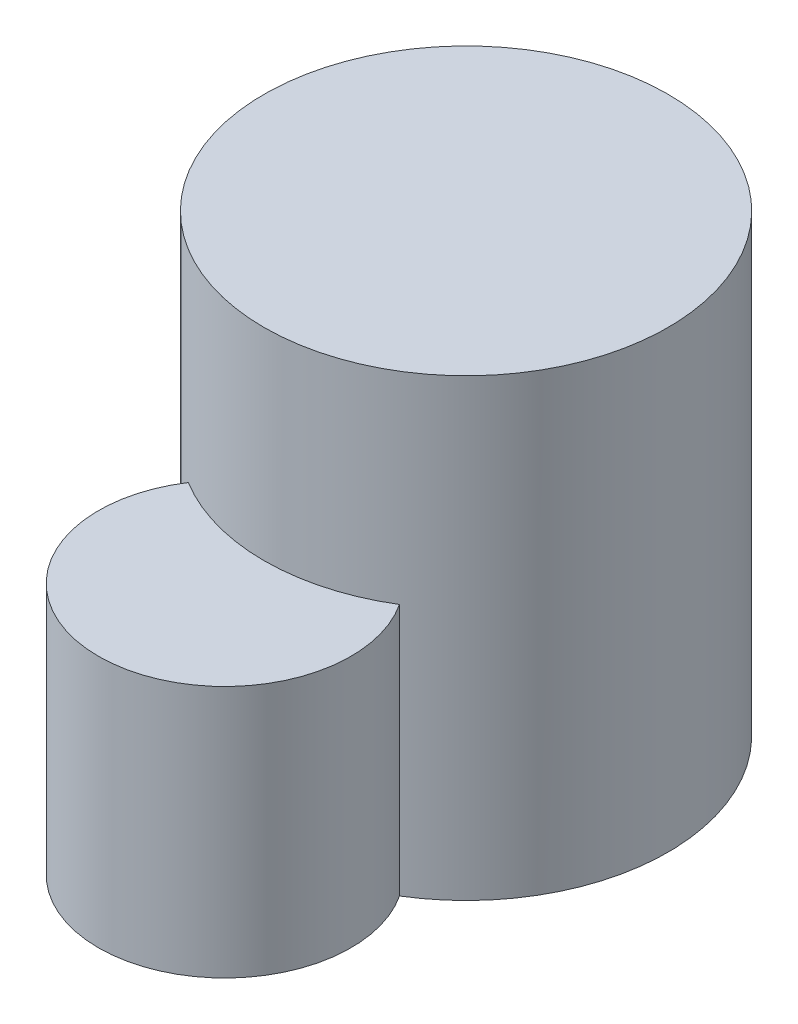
ISO-10303-21;
HEADER;
FILE_DESCRIPTION(('STEP AP214'),'2;1');
FILE_NAME('part.step','',(''),(''),'','','');
FILE_SCHEMA(('AUTOMOTIVE_DESIGN { 1 0 10303 214 1 1 1 1 }'));
ENDSEC;
DATA;
#1=APPLICATION_CONTEXT('core data for automotive mechanical design processes');
#2=APPLICATION_PROTOCOL_DEFINITION('international standard','automotive_design',2000,#1);
#3=PRODUCT_CONTEXT('',#1,'mechanical');
#4=PRODUCT('Part','Part','',(#3));
#5=PRODUCT_RELATED_PRODUCT_CATEGORY('part','',(#4));
#6=PRODUCT_DEFINITION_FORMATION('','',#4);
#7=PRODUCT_DEFINITION_CONTEXT('part definition',#1,'design');
#8=PRODUCT_DEFINITION('design','',#6,#7);
#9=PRODUCT_DEFINITION_SHAPE('','',#8);
#10=(LENGTH_UNIT() NAMED_UNIT(*) SI_UNIT(.MILLI.,.METRE.));
#11=(NAMED_UNIT(*) PLANE_ANGLE_UNIT() SI_UNIT($,.RADIAN.));
#12=(NAMED_UNIT(*) SI_UNIT($,.STERADIAN.) SOLID_ANGLE_UNIT());
#13=UNCERTAINTY_MEASURE_WITH_UNIT(LENGTH_MEASURE(1.E-05),#10,'distance_accuracy_value','');
#14=(GEOMETRIC_REPRESENTATION_CONTEXT(3) GLOBAL_UNCERTAINTY_ASSIGNED_CONTEXT((#13)) GLOBAL_UNIT_ASSIGNED_CONTEXT((#10,
#11,#12)) REPRESENTATION_CONTEXT('',''));
#15=CARTESIAN_POINT('',(0.,0.,0.));
#16=DIRECTION('',(0.,0.,1.));
#17=DIRECTION('',(1.,0.,0.));
#18=AXIS2_PLACEMENT_3D('',#15,#16,#17);
#19=CARTESIAN_POINT('',(0.,18.,0.));
#20=DIRECTION('',(0.,-1.,0.));
#21=DIRECTION('',(0.,0.,-1.));
#22=AXIS2_PLACEMENT_3D('',#19,#20,#21);
#23=CYLINDRICAL_SURFACE('',#22,8.);
#24=CARTESIAN_POINT('',(0.,18.,0.));
#25=DIRECTION('',(0.,1.,0.));
#26=DIRECTION('',(0.,0.,1.));
#27=AXIS2_PLACEMENT_3D('',#24,#25,#26);
#28=CIRCLE('',#27,8.);
#29=CARTESIAN_POINT('',(0.,18.,8.));
#30=VERTEX_POINT('',#29);
#31=EDGE_CURVE('E38',#30,#30,#28,.T.);
#32=ORIENTED_EDGE('',*,*,#31,.F.);
#33=EDGE_LOOP('',(#32));
#34=FACE_BOUND('',#33,.T.);
#35=DIRECTION('',(0.,-1.,0.));
#36=VECTOR('',#35,1.);
#37=CARTESIAN_POINT('',(-4.18287211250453,5.,6.81935340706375));
#38=LINE('',#37,#36);
#39=CARTESIAN_POINT('',(-4.18287211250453,10.,6.81935340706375));
#40=VERTEX_POINT('',#39);
#41=CARTESIAN_POINT('',(-4.18287211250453,0.,6.81935340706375));
#42=VERTEX_POINT('',#41);
#43=EDGE_CURVE('E48',#40,#42,#38,.T.);
#44=ORIENTED_EDGE('',*,*,#43,.F.);
#45=CARTESIAN_POINT('',(0.,10.,0.));
#46=DIRECTION('',(0.,1.,0.));
#47=DIRECTION('',(0.,0.,1.));
#48=AXIS2_PLACEMENT_3D('',#45,#46,#47);
#49=CIRCLE('',#48,8.);
#50=CARTESIAN_POINT('',(4.18287211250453,10.,6.81935340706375));
#51=VERTEX_POINT('',#50);
#52=EDGE_CURVE('E11',#40,#51,#49,.T.);
#53=ORIENTED_EDGE('',*,*,#52,.T.);
#54=DIRECTION('',(0.,-1.,0.));
#55=VECTOR('',#54,1.);
#56=CARTESIAN_POINT('',(4.18287211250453,5.,6.81935340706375));
#57=LINE('',#56,#55);
#58=CARTESIAN_POINT('',(4.18287211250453,0.,6.81935340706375));
#59=VERTEX_POINT('',#58);
#60=EDGE_CURVE('E59',#59,#51,#57,.F.);
#61=ORIENTED_EDGE('',*,*,#60,.F.);
#62=CARTESIAN_POINT('',(0.,0.,0.));
#63=DIRECTION('',(0.,1.,0.));
#64=DIRECTION('',(0.,0.,1.));
#65=AXIS2_PLACEMENT_3D('',#62,#63,#64);
#66=CIRCLE('',#65,8.);
#67=EDGE_CURVE('E55',#59,#42,#66,.T.);
#68=ORIENTED_EDGE('',*,*,#67,.T.);
#69=EDGE_LOOP('',(#44,#53,#61,#68));
#70=FACE_BOUND('',#69,.T.);
#71=ADVANCED_FACE('F31',(#34,#70),#23,.T.);
#72=CARTESIAN_POINT('',(0.,18.,0.));
#73=DIRECTION('',(0.,1.,0.));
#74=DIRECTION('',(0.,0.,1.));
#75=AXIS2_PLACEMENT_3D('',#72,#73,#74);
#76=PLANE('',#75);
#77=ORIENTED_EDGE('',*,*,#31,.T.);
#78=EDGE_LOOP('',(#77));
#79=FACE_BOUND('',#78,.T.);
#80=ADVANCED_FACE('F73',(#79),#76,.T.);
#81=CARTESIAN_POINT('',(0.,0.,0.));
#82=DIRECTION('',(0.,1.,0.));
#83=DIRECTION('',(0.,0.,1.));
#84=AXIS2_PLACEMENT_3D('',#81,#82,#83);
#85=PLANE('',#84);
#86=ORIENTED_EDGE('',*,*,#67,.F.);
#87=CARTESIAN_POINT('',(0.,0.,9.55861989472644));
#88=DIRECTION('',(0.,1.,0.));
#89=DIRECTION('',(0.,0.,1.));
#90=AXIS2_PLACEMENT_3D('',#87,#88,#89);
#91=CIRCLE('',#90,5.);
#92=EDGE_CURVE('E58',#42,#59,#91,.T.);
#93=ORIENTED_EDGE('',*,*,#92,.F.);
#94=EDGE_LOOP('',(#86,#93));
#95=FACE_BOUND('',#94,.T.);
#96=ADVANCED_FACE('F56',(#95),#85,.F.);
#97=CARTESIAN_POINT('',(0.,10.,9.55861989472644));
#98=DIRECTION('',(0.,1.,0.));
#99=DIRECTION('',(0.,0.,1.));
#100=AXIS2_PLACEMENT_3D('',#97,#98,#99);
#101=PLANE('',#100);
#102=ORIENTED_EDGE('',*,*,#52,.F.);
#103=CARTESIAN_POINT('',(0.,10.,9.55861989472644));
#104=DIRECTION('',(0.,1.,0.));
#105=DIRECTION('',(0.,0.,1.));
#106=AXIS2_PLACEMENT_3D('',#103,#104,#105);
#107=CIRCLE('',#106,5.);
#108=EDGE_CURVE('E63',#40,#51,#107,.T.);
#109=ORIENTED_EDGE('',*,*,#108,.T.);
#110=EDGE_LOOP('',(#102,#109));
#111=FACE_BOUND('',#110,.T.);
#112=ADVANCED_FACE('F83',(#111),#101,.T.);
#113=CARTESIAN_POINT('',(0.,10.,9.55861989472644));
#114=DIRECTION('',(0.,-1.,0.));
#115=DIRECTION('',(0.,0.,-1.));
#116=AXIS2_PLACEMENT_3D('',#113,#114,#115);
#117=CYLINDRICAL_SURFACE('',#116,5.);
#118=ORIENTED_EDGE('',*,*,#108,.F.);
#119=ORIENTED_EDGE('',*,*,#43,.T.);
#120=ORIENTED_EDGE('',*,*,#92,.T.);
#121=ORIENTED_EDGE('',*,*,#60,.T.);
#122=EDGE_LOOP('',(#118,#119,#120,#121));
#123=FACE_BOUND('',#122,.T.);
#124=ADVANCED_FACE('F65',(#123),#117,.T.);
#125=CLOSED_SHELL('',(#71,#80,#96,#112,#124));
#126=MANIFOLD_SOLID_BREP('B2',#125);
#127=ADVANCED_BREP_SHAPE_REPRESENTATION('',(#18,#126),#14);
#128=SHAPE_DEFINITION_REPRESENTATION(#9,#127);
ENDSEC;
END-ISO-10303-21;
